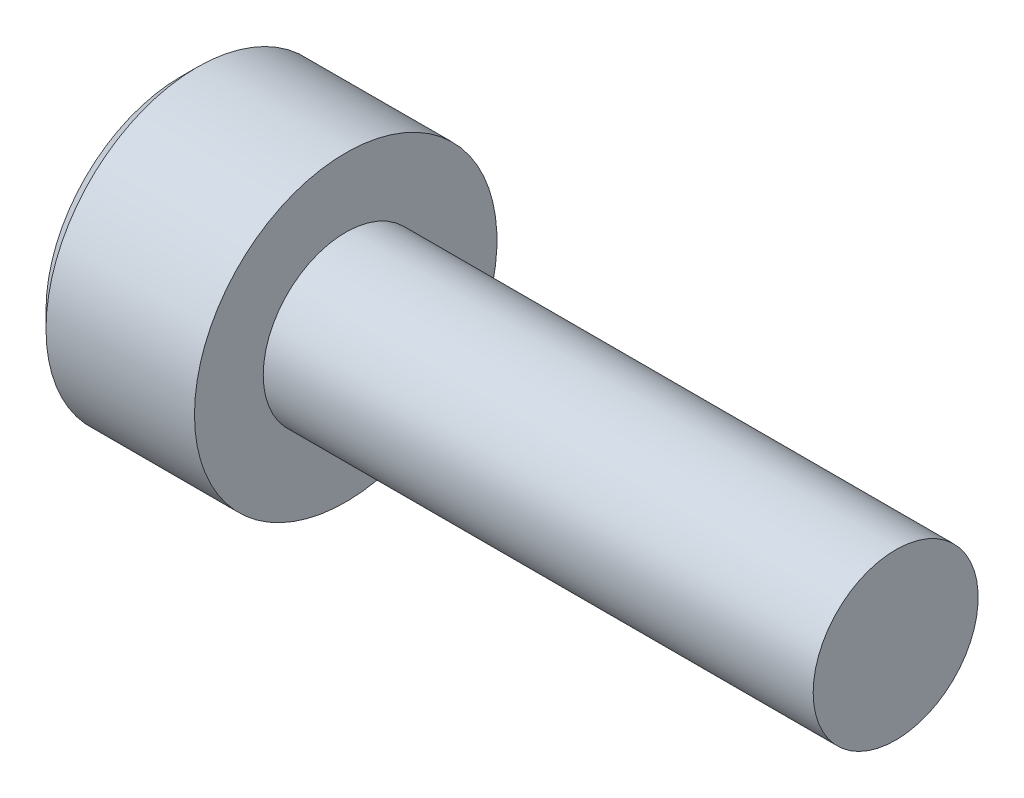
ISO-10303-21;
HEADER;
FILE_DESCRIPTION(('STEP AP214'),'2;1');
FILE_NAME('part.step','',(''),(''),'','','');
FILE_SCHEMA(('AUTOMOTIVE_DESIGN { 1 0 10303 214 1 1 1 1 }'));
ENDSEC;
DATA;
#1=APPLICATION_CONTEXT('core data for automotive mechanical design processes');
#2=APPLICATION_PROTOCOL_DEFINITION('international standard','automotive_design',2000,#1);
#3=PRODUCT_CONTEXT('',#1,'mechanical');
#4=PRODUCT('Part','Part','',(#3));
#5=PRODUCT_RELATED_PRODUCT_CATEGORY('part','',(#4));
#6=PRODUCT_DEFINITION_FORMATION('','',#4);
#7=PRODUCT_DEFINITION_CONTEXT('part definition',#1,'design');
#8=PRODUCT_DEFINITION('design','',#6,#7);
#9=PRODUCT_DEFINITION_SHAPE('','',#8);
#10=(LENGTH_UNIT() NAMED_UNIT(*) SI_UNIT(.MILLI.,.METRE.));
#11=(NAMED_UNIT(*) PLANE_ANGLE_UNIT() SI_UNIT($,.RADIAN.));
#12=(NAMED_UNIT(*) SI_UNIT($,.STERADIAN.) SOLID_ANGLE_UNIT());
#13=UNCERTAINTY_MEASURE_WITH_UNIT(LENGTH_MEASURE(1.E-05),#10,'distance_accuracy_value','');
#14=(GEOMETRIC_REPRESENTATION_CONTEXT(3) GLOBAL_UNCERTAINTY_ASSIGNED_CONTEXT((#13)) GLOBAL_UNIT_ASSIGNED_CONTEXT((#10,
#11,#12)) REPRESENTATION_CONTEXT('',''));
#15=CARTESIAN_POINT('',(0.,0.,0.));
#16=DIRECTION('',(0.,0.,1.));
#17=DIRECTION('',(1.,0.,0.));
#18=AXIS2_PLACEMENT_3D('',#15,#16,#17);
#19=CARTESIAN_POINT('',(-3.,2.75,0.));
#20=DIRECTION('',(1.,0.,0.));
#21=DIRECTION('',(0.,0.,-1.));
#22=AXIS2_PLACEMENT_3D('',#19,#20,#21);
#23=PLANE('',#22);
#24=CARTESIAN_POINT('',(-3.,0.,0.));
#25=DIRECTION('',(1.,0.,0.));
#26=DIRECTION('',(0.,0.,-1.));
#27=AXIS2_PLACEMENT_3D('',#24,#25,#26);
#28=CIRCLE('',#27,2.45000000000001);
#29=CARTESIAN_POINT('',(-3.,0.,-2.45000000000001));
#30=VERTEX_POINT('',#29);
#31=EDGE_CURVE('E45',#30,#30,#28,.F.);
#32=ORIENTED_EDGE('',*,*,#31,.T.);
#33=EDGE_LOOP('',(#32));
#34=FACE_BOUND('',#33,.T.);
#35=DIRECTION('',(0.,0.5,0.866025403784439));
#36=VECTOR('',#35,1.);
#37=CARTESIAN_POINT('',(-3.,-1.44337567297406,0.));
#38=LINE('',#37,#36);
#39=CARTESIAN_POINT('',(-3.,-1.44337567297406,0.));
#40=VERTEX_POINT('',#39);
#41=CARTESIAN_POINT('',(-3.,-0.721687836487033,1.25));
#42=VERTEX_POINT('',#41);
#43=EDGE_CURVE('E152',#40,#42,#38,.T.);
#44=ORIENTED_EDGE('',*,*,#43,.F.);
#45=DIRECTION('',(0.,-0.5,0.866025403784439));
#46=VECTOR('',#45,1.);
#47=CARTESIAN_POINT('',(-3.,-0.721687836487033,-1.25));
#48=LINE('',#47,#46);
#49=CARTESIAN_POINT('',(-3.,-0.721687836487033,-1.25));
#50=VERTEX_POINT('',#49);
#51=EDGE_CURVE('E52',#50,#40,#48,.T.);
#52=ORIENTED_EDGE('',*,*,#51,.F.);
#53=DIRECTION('',(0.,-1.,0.));
#54=VECTOR('',#53,1.);
#55=CARTESIAN_POINT('',(-3.,0.721687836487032,-1.25));
#56=LINE('',#55,#54);
#57=CARTESIAN_POINT('',(-3.,0.721687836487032,-1.25));
#58=VERTEX_POINT('',#57);
#59=EDGE_CURVE('E122',#58,#50,#56,.T.);
#60=ORIENTED_EDGE('',*,*,#59,.F.);
#61=DIRECTION('',(0.,-0.5,-0.866025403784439));
#62=VECTOR('',#61,1.);
#63=CARTESIAN_POINT('',(-3.,1.44337567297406,0.));
#64=LINE('',#63,#62);
#65=CARTESIAN_POINT('',(-3.,1.44337567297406,0.));
#66=VERTEX_POINT('',#65);
#67=EDGE_CURVE('E158',#66,#58,#64,.T.);
#68=ORIENTED_EDGE('',*,*,#67,.F.);
#69=DIRECTION('',(0.,0.5,-0.866025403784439));
#70=VECTOR('',#69,1.);
#71=CARTESIAN_POINT('',(-3.,0.721687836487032,1.25));
#72=LINE('',#71,#70);
#73=CARTESIAN_POINT('',(-3.,0.721687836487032,1.25));
#74=VERTEX_POINT('',#73);
#75=EDGE_CURVE('E156',#74,#66,#72,.T.);
#76=ORIENTED_EDGE('',*,*,#75,.F.);
#77=DIRECTION('',(0.,1.,0.));
#78=VECTOR('',#77,1.);
#79=CARTESIAN_POINT('',(-3.,-0.721687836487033,1.25));
#80=LINE('',#79,#78);
#81=EDGE_CURVE('E154',#42,#74,#80,.T.);
#82=ORIENTED_EDGE('',*,*,#81,.F.);
#83=EDGE_LOOP('',(#44,#52,#60,#68,#76,#82));
#84=FACE_BOUND('',#83,.T.);
#85=ADVANCED_FACE('F37',(#34,#84),#23,.F.);
#86=CARTESIAN_POINT('',(10.,0.,0.));
#87=DIRECTION('',(-1.,0.,0.));
#88=DIRECTION('',(0.,0.,1.));
#89=AXIS2_PLACEMENT_3D('',#86,#87,#88);
#90=PLANE('',#89);
#91=CARTESIAN_POINT('',(10.,0.,0.));
#92=DIRECTION('',(-1.,0.,0.));
#93=DIRECTION('',(0.,0.,1.));
#94=AXIS2_PLACEMENT_3D('',#91,#92,#93);
#95=CIRCLE('',#94,1.5);
#96=CARTESIAN_POINT('',(10.,0.,1.5));
#97=VERTEX_POINT('',#96);
#98=EDGE_CURVE('E184',#97,#97,#95,.T.);
#99=ORIENTED_EDGE('',*,*,#98,.F.);
#100=EDGE_LOOP('',(#99));
#101=FACE_BOUND('',#100,.T.);
#102=ADVANCED_FACE('F205',(#101),#90,.F.);
#103=CARTESIAN_POINT('',(-3.,0.,0.));
#104=DIRECTION('',(-1.,0.,0.));
#105=DIRECTION('',(0.,0.,1.));
#106=AXIS2_PLACEMENT_3D('',#103,#104,#105);
#107=CYLINDRICAL_SURFACE('',#106,1.5);
#108=CARTESIAN_POINT('',(0.,0.,0.));
#109=DIRECTION('',(-1.,0.,0.));
#110=DIRECTION('',(0.,0.,1.));
#111=AXIS2_PLACEMENT_3D('',#108,#109,#110);
#112=CIRCLE('',#111,1.5);
#113=CARTESIAN_POINT('',(0.,0.,1.5));
#114=VERTEX_POINT('',#113);
#115=EDGE_CURVE('E181',#114,#114,#112,.T.);
#116=ORIENTED_EDGE('',*,*,#115,.F.);
#117=EDGE_LOOP('',(#116));
#118=FACE_BOUND('',#117,.T.);
#119=ORIENTED_EDGE('',*,*,#98,.T.);
#120=EDGE_LOOP('',(#119));
#121=FACE_BOUND('',#120,.T.);
#122=ADVANCED_FACE('F209',(#118,#121),#107,.T.);
#123=CARTESIAN_POINT('',(0.,1.5,0.));
#124=DIRECTION('',(-1.,0.,0.));
#125=DIRECTION('',(0.,0.,1.));
#126=AXIS2_PLACEMENT_3D('',#123,#124,#125);
#127=PLANE('',#126);
#128=CARTESIAN_POINT('',(0.,0.,0.));
#129=DIRECTION('',(-1.,0.,0.));
#130=DIRECTION('',(0.,0.,1.));
#131=AXIS2_PLACEMENT_3D('',#128,#129,#130);
#132=CIRCLE('',#131,2.75);
#133=CARTESIAN_POINT('',(0.,0.,2.75));
#134=VERTEX_POINT('',#133);
#135=EDGE_CURVE('E177',#134,#134,#132,.T.);
#136=ORIENTED_EDGE('',*,*,#135,.F.);
#137=EDGE_LOOP('',(#136));
#138=FACE_BOUND('',#137,.T.);
#139=ORIENTED_EDGE('',*,*,#115,.T.);
#140=EDGE_LOOP('',(#139));
#141=FACE_BOUND('',#140,.T.);
#142=ADVANCED_FACE('F200',(#138,#141),#127,.F.);
#143=CARTESIAN_POINT('',(-3.,0.,0.));
#144=DIRECTION('',(-1.,0.,0.));
#145=DIRECTION('',(0.,0.,1.));
#146=AXIS2_PLACEMENT_3D('',#143,#144,#145);
#147=CYLINDRICAL_SURFACE('',#146,2.75);
#148=CARTESIAN_POINT('',(-2.70000000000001,0.,0.));
#149=DIRECTION('',(1.,0.,0.));
#150=DIRECTION('',(0.,0.,-1.));
#151=AXIS2_PLACEMENT_3D('',#148,#149,#150);
#152=CIRCLE('',#151,2.75);
#153=CARTESIAN_POINT('',(-2.70000000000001,0.,-2.75));
#154=VERTEX_POINT('',#153);
#155=EDGE_CURVE('E11',#154,#154,#152,.T.);
#156=ORIENTED_EDGE('',*,*,#155,.T.);
#157=EDGE_LOOP('',(#156));
#158=FACE_BOUND('',#157,.T.);
#159=ORIENTED_EDGE('',*,*,#135,.T.);
#160=EDGE_LOOP('',(#159));
#161=FACE_BOUND('',#160,.T.);
#162=ADVANCED_FACE('F192',(#158,#161),#147,.T.);
#163=CARTESIAN_POINT('',(-3.,0.,0.));
#164=DIRECTION('',(1.,0.,0.));
#165=DIRECTION('',(0.,0.,-1.));
#166=AXIS2_PLACEMENT_3D('',#163,#164,#165);
#167=CONICAL_SURFACE('',#166,2.45000000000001,0.785398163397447);
#168=ORIENTED_EDGE('',*,*,#155,.F.);
#169=EDGE_LOOP('',(#168));
#170=FACE_BOUND('',#169,.T.);
#171=ORIENTED_EDGE('',*,*,#31,.F.);
#172=EDGE_LOOP('',(#171));
#173=FACE_BOUND('',#172,.T.);
#174=ADVANCED_FACE('F39',(#170,#173),#167,.T.);
#175=CARTESIAN_POINT('',(-1.7,-0.721687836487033,-1.25));
#176=DIRECTION('',(0.,-0.866025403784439,-0.5));
#177=DIRECTION('',(0.,0.5,-0.866025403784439));
#178=AXIS2_PLACEMENT_3D('',#175,#176,#177);
#179=PLANE('',#178);
#180=DIRECTION('',(0.,-0.5,0.866025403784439));
#181=VECTOR('',#180,1.);
#182=CARTESIAN_POINT('',(-1.7,-0.721687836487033,-1.25));
#183=LINE('',#182,#181);
#184=CARTESIAN_POINT('',(-1.7,-0.721687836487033,-1.25));
#185=VERTEX_POINT('',#184);
#186=CARTESIAN_POINT('',(-1.7,-1.08253175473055,-0.625));
#187=VERTEX_POINT('',#186);
#188=EDGE_CURVE('E121',#185,#187,#183,.T.);
#189=ORIENTED_EDGE('',*,*,#188,.F.);
#190=DIRECTION('',(-1.,0.,0.));
#191=VECTOR('',#190,1.);
#192=CARTESIAN_POINT('',(-1.7,-0.721687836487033,-1.25));
#193=LINE('',#192,#191);
#194=EDGE_CURVE('E161',#185,#50,#193,.T.);
#195=ORIENTED_EDGE('',*,*,#194,.T.);
#196=ORIENTED_EDGE('',*,*,#51,.T.);
#197=DIRECTION('',(-1.,0.,0.));
#198=VECTOR('',#197,1.);
#199=CARTESIAN_POINT('',(-1.7,-1.44337567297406,0.));
#200=LINE('',#199,#198);
#201=CARTESIAN_POINT('',(-1.7,-1.44337567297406,0.));
#202=VERTEX_POINT('',#201);
#203=EDGE_CURVE('E124',#202,#40,#200,.T.);
#204=ORIENTED_EDGE('',*,*,#203,.F.);
#205=EDGE_CURVE('E113',#187,#202,#183,.T.);
#206=ORIENTED_EDGE('',*,*,#205,.F.);
#207=EDGE_LOOP('',(#189,#195,#196,#204,#206));
#208=FACE_BOUND('',#207,.T.);
#209=ADVANCED_FACE('F125',(#208),#179,.F.);
#210=CARTESIAN_POINT('',(-1.7,0.721687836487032,-1.25));
#211=DIRECTION('',(0.,0.,-1.));
#212=DIRECTION('',(0.,1.,0.));
#213=AXIS2_PLACEMENT_3D('',#210,#211,#212);
#214=PLANE('',#213);
#215=DIRECTION('',(0.,-1.,0.));
#216=VECTOR('',#215,1.);
#217=CARTESIAN_POINT('',(-1.7,0.721687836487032,-1.25));
#218=LINE('',#217,#216);
#219=CARTESIAN_POINT('',(-1.7,0.721687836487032,-1.25));
#220=VERTEX_POINT('',#219);
#221=CARTESIAN_POINT('',(-1.7,0.,-1.25));
#222=VERTEX_POINT('',#221);
#223=EDGE_CURVE('E130',#220,#222,#218,.T.);
#224=ORIENTED_EDGE('',*,*,#223,.F.);
#225=DIRECTION('',(-1.,0.,0.));
#226=VECTOR('',#225,1.);
#227=CARTESIAN_POINT('',(-1.7,0.721687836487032,-1.25));
#228=LINE('',#227,#226);
#229=EDGE_CURVE('E163',#220,#58,#228,.T.);
#230=ORIENTED_EDGE('',*,*,#229,.T.);
#231=ORIENTED_EDGE('',*,*,#59,.T.);
#232=ORIENTED_EDGE('',*,*,#194,.F.);
#233=EDGE_CURVE('E148',#222,#185,#218,.T.);
#234=ORIENTED_EDGE('',*,*,#233,.F.);
#235=EDGE_LOOP('',(#224,#230,#231,#232,#234));
#236=FACE_BOUND('',#235,.T.);
#237=ADVANCED_FACE('F198',(#236),#214,.F.);
#238=CARTESIAN_POINT('',(-1.7,1.44337567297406,0.));
#239=DIRECTION('',(0.,0.866025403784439,-0.5));
#240=DIRECTION('',(0.,0.5,0.866025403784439));
#241=AXIS2_PLACEMENT_3D('',#238,#239,#240);
#242=PLANE('',#241);
#243=DIRECTION('',(0.,-0.5,-0.866025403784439));
#244=VECTOR('',#243,1.);
#245=CARTESIAN_POINT('',(-1.7,1.44337567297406,0.));
#246=LINE('',#245,#244);
#247=CARTESIAN_POINT('',(-1.7,1.44337567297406,0.));
#248=VERTEX_POINT('',#247);
#249=CARTESIAN_POINT('',(-1.7,1.08253175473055,-0.625));
#250=VERTEX_POINT('',#249);
#251=EDGE_CURVE('E145',#248,#250,#246,.T.);
#252=ORIENTED_EDGE('',*,*,#251,.F.);
#253=DIRECTION('',(-1.,0.,0.));
#254=VECTOR('',#253,1.);
#255=CARTESIAN_POINT('',(-1.7,1.44337567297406,0.));
#256=LINE('',#255,#254);
#257=EDGE_CURVE('E166',#248,#66,#256,.T.);
#258=ORIENTED_EDGE('',*,*,#257,.T.);
#259=ORIENTED_EDGE('',*,*,#67,.T.);
#260=ORIENTED_EDGE('',*,*,#229,.F.);
#261=EDGE_CURVE('E144',#250,#220,#246,.T.);
#262=ORIENTED_EDGE('',*,*,#261,.F.);
#263=EDGE_LOOP('',(#252,#258,#259,#260,#262));
#264=FACE_BOUND('',#263,.T.);
#265=ADVANCED_FACE('F234',(#264),#242,.F.);
#266=CARTESIAN_POINT('',(-1.7,0.721687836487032,1.25));
#267=DIRECTION('',(0.,0.866025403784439,0.5));
#268=DIRECTION('',(0.,-0.5,0.866025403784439));
#269=AXIS2_PLACEMENT_3D('',#266,#267,#268);
#270=PLANE('',#269);
#271=DIRECTION('',(0.,0.5,-0.866025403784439));
#272=VECTOR('',#271,1.);
#273=CARTESIAN_POINT('',(-1.7,0.721687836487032,1.25));
#274=LINE('',#273,#272);
#275=CARTESIAN_POINT('',(-1.7,0.721687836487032,1.25));
#276=VERTEX_POINT('',#275);
#277=CARTESIAN_POINT('',(-1.7,1.08253175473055,0.624999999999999));
#278=VERTEX_POINT('',#277);
#279=EDGE_CURVE('E141',#276,#278,#274,.T.);
#280=ORIENTED_EDGE('',*,*,#279,.F.);
#281=DIRECTION('',(-1.,0.,0.));
#282=VECTOR('',#281,1.);
#283=CARTESIAN_POINT('',(-1.7,0.721687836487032,1.25));
#284=LINE('',#283,#282);
#285=EDGE_CURVE('E169',#276,#74,#284,.T.);
#286=ORIENTED_EDGE('',*,*,#285,.T.);
#287=ORIENTED_EDGE('',*,*,#75,.T.);
#288=ORIENTED_EDGE('',*,*,#257,.F.);
#289=EDGE_CURVE('E140',#278,#248,#274,.T.);
#290=ORIENTED_EDGE('',*,*,#289,.F.);
#291=EDGE_LOOP('',(#280,#286,#287,#288,#290));
#292=FACE_BOUND('',#291,.T.);
#293=ADVANCED_FACE('F230',(#292),#270,.F.);
#294=CARTESIAN_POINT('',(-1.7,-0.721687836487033,1.25));
#295=DIRECTION('',(0.,0.,1.));
#296=DIRECTION('',(1.,0.,0.));
#297=AXIS2_PLACEMENT_3D('',#294,#295,#296);
#298=PLANE('',#297);
#299=DIRECTION('',(0.,1.,0.));
#300=VECTOR('',#299,1.);
#301=CARTESIAN_POINT('',(-1.7,-0.721687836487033,1.25));
#302=LINE('',#301,#300);
#303=CARTESIAN_POINT('',(-1.7,-0.721687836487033,1.25));
#304=VERTEX_POINT('',#303);
#305=CARTESIAN_POINT('',(-1.7,0.,1.25));
#306=VERTEX_POINT('',#305);
#307=EDGE_CURVE('E60',#304,#306,#302,.T.);
#308=ORIENTED_EDGE('',*,*,#307,.F.);
#309=DIRECTION('',(-1.,0.,0.));
#310=VECTOR('',#309,1.);
#311=CARTESIAN_POINT('',(-1.7,-0.721687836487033,1.25));
#312=LINE('',#311,#310);
#313=EDGE_CURVE('E129',#304,#42,#312,.T.);
#314=ORIENTED_EDGE('',*,*,#313,.T.);
#315=ORIENTED_EDGE('',*,*,#81,.T.);
#316=ORIENTED_EDGE('',*,*,#285,.F.);
#317=EDGE_CURVE('E136',#306,#276,#302,.T.);
#318=ORIENTED_EDGE('',*,*,#317,.F.);
#319=EDGE_LOOP('',(#308,#314,#315,#316,#318));
#320=FACE_BOUND('',#319,.T.);
#321=ADVANCED_FACE('F227',(#320),#298,.F.);
#322=CARTESIAN_POINT('',(-1.7,-1.44337567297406,0.));
#323=DIRECTION('',(0.,-0.866025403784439,0.5));
#324=DIRECTION('',(0.,-0.5,-0.866025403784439));
#325=AXIS2_PLACEMENT_3D('',#322,#323,#324);
#326=PLANE('',#325);
#327=DIRECTION('',(0.,0.5,0.866025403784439));
#328=VECTOR('',#327,1.);
#329=CARTESIAN_POINT('',(-1.7,-1.44337567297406,0.));
#330=LINE('',#329,#328);
#331=CARTESIAN_POINT('',(-1.7,-1.08253175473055,0.625));
#332=VERTEX_POINT('',#331);
#333=EDGE_CURVE('E116',#202,#332,#330,.T.);
#334=ORIENTED_EDGE('',*,*,#333,.F.);
#335=ORIENTED_EDGE('',*,*,#203,.T.);
#336=ORIENTED_EDGE('',*,*,#43,.T.);
#337=ORIENTED_EDGE('',*,*,#313,.F.);
#338=EDGE_CURVE('E135',#332,#304,#330,.T.);
#339=ORIENTED_EDGE('',*,*,#338,.F.);
#340=EDGE_LOOP('',(#334,#335,#336,#337,#339));
#341=FACE_BOUND('',#340,.T.);
#342=ADVANCED_FACE('F133',(#341),#326,.F.);
#343=CARTESIAN_POINT('',(-1.7,0.,0.));
#344=DIRECTION('',(-1.,0.,0.));
#345=DIRECTION('',(0.,0.,1.));
#346=AXIS2_PLACEMENT_3D('',#343,#344,#345);
#347=PLANE('',#346);
#348=ORIENTED_EDGE('',*,*,#317,.T.);
#349=ORIENTED_EDGE('',*,*,#279,.T.);
#350=CARTESIAN_POINT('',(-1.7,0.,0.));
#351=DIRECTION('',(-1.,0.,0.));
#352=DIRECTION('',(0.,-1.,0.));
#353=AXIS2_PLACEMENT_3D('',#350,#351,#352);
#354=CIRCLE('',#353,1.25);
#355=EDGE_CURVE('E178',#306,#278,#354,.T.);
#356=ORIENTED_EDGE('',*,*,#355,.F.);
#357=EDGE_LOOP('',(#348,#349,#356));
#358=FACE_BOUND('',#357,.T.);
#359=ADVANCED_FACE('F226',(#358),#347,.T.);
#360=ORIENTED_EDGE('',*,*,#289,.T.);
#361=ORIENTED_EDGE('',*,*,#251,.T.);
#362=EDGE_CURVE('E264',#278,#250,#354,.T.);
#363=ORIENTED_EDGE('',*,*,#362,.F.);
#364=EDGE_LOOP('',(#360,#361,#363));
#365=FACE_BOUND('',#364,.T.);
#366=ADVANCED_FACE('F248',(#365),#347,.T.);
#367=ORIENTED_EDGE('',*,*,#261,.T.);
#368=ORIENTED_EDGE('',*,*,#223,.T.);
#369=EDGE_CURVE('E266',#250,#222,#354,.T.);
#370=ORIENTED_EDGE('',*,*,#369,.F.);
#371=EDGE_LOOP('',(#367,#368,#370));
#372=FACE_BOUND('',#371,.T.);
#373=ADVANCED_FACE('F253',(#372),#347,.T.);
#374=ORIENTED_EDGE('',*,*,#233,.T.);
#375=ORIENTED_EDGE('',*,*,#188,.T.);
#376=EDGE_CURVE('E267',#222,#187,#354,.T.);
#377=ORIENTED_EDGE('',*,*,#376,.F.);
#378=EDGE_LOOP('',(#374,#375,#377));
#379=FACE_BOUND('',#378,.T.);
#380=ADVANCED_FACE('F246',(#379),#347,.T.);
#381=ORIENTED_EDGE('',*,*,#205,.T.);
#382=ORIENTED_EDGE('',*,*,#333,.T.);
#383=EDGE_CURVE('E118',#187,#332,#354,.T.);
#384=ORIENTED_EDGE('',*,*,#383,.F.);
#385=EDGE_LOOP('',(#381,#382,#384));
#386=FACE_BOUND('',#385,.T.);
#387=ADVANCED_FACE('F114',(#386),#347,.T.);
#388=ORIENTED_EDGE('',*,*,#338,.T.);
#389=ORIENTED_EDGE('',*,*,#307,.T.);
#390=EDGE_CURVE('E174',#332,#306,#354,.T.);
#391=ORIENTED_EDGE('',*,*,#390,.F.);
#392=EDGE_LOOP('',(#388,#389,#391));
#393=FACE_BOUND('',#392,.T.);
#394=ADVANCED_FACE('F221',(#393),#347,.T.);
#395=CARTESIAN_POINT('',(-0.948924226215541,0.,0.));
#396=DIRECTION('',(-1.,0.,0.));
#397=DIRECTION('',(0.,-1.,0.));
#398=AXIS2_PLACEMENT_3D('',#395,#396,#397);
#399=CONICAL_SURFACE('',#398,0.,1.02974425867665);
#400=ORIENTED_EDGE('',*,*,#390,.T.);
#401=ORIENTED_EDGE('',*,*,#355,.T.);
#402=ORIENTED_EDGE('',*,*,#362,.T.);
#403=ORIENTED_EDGE('',*,*,#369,.T.);
#404=ORIENTED_EDGE('',*,*,#376,.T.);
#405=ORIENTED_EDGE('',*,*,#383,.T.);
#406=EDGE_LOOP('',(#400,#401,#402,#403,#404,#405));
#407=FACE_BOUND('',#406,.T.);
#408=CARTESIAN_POINT('',(-0.948924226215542,0.,0.));
#409=VERTEX_POINT('',#408);
#410=VERTEX_LOOP('',#409);
#411=FACE_BOUND('',#410,.T.);
#412=ADVANCED_FACE('F219',(#407,#411),#399,.F.);
#413=CLOSED_SHELL('',(#85,#102,#122,#142,#162,#174,#209,#237,#265,#293,#321,#342,#359,#366,#373,
#380,#387,#394,#412));
#414=MANIFOLD_SOLID_BREP('B2',#413);
#415=ADVANCED_BREP_SHAPE_REPRESENTATION('',(#18,#414),#14);
#416=SHAPE_DEFINITION_REPRESENTATION(#9,#415);
ENDSEC;
END-ISO-10303-21;
